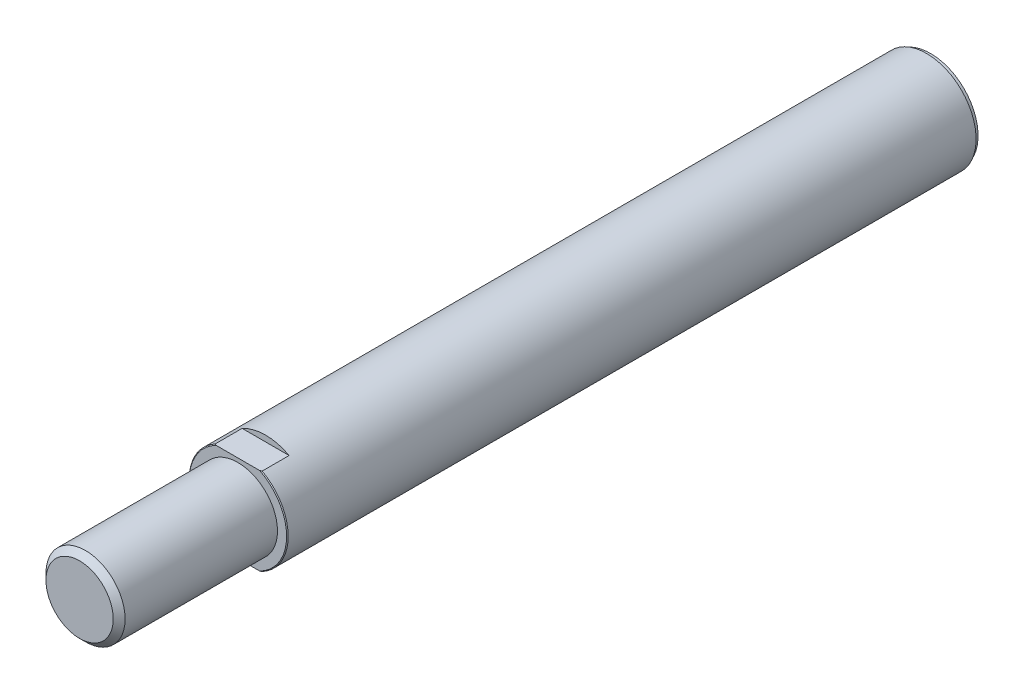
ISO-10303-21;
HEADER;
FILE_DESCRIPTION(('STEP AP214'),'2;1');
FILE_NAME('part.step','',(''),(''),'','','');
FILE_SCHEMA(('AUTOMOTIVE_DESIGN { 1 0 10303 214 1 1 1 1 }'));
ENDSEC;
DATA;
#1=APPLICATION_CONTEXT('core data for automotive mechanical design processes');
#2=APPLICATION_PROTOCOL_DEFINITION('international standard','automotive_design',2000,#1);
#3=PRODUCT_CONTEXT('',#1,'mechanical');
#4=PRODUCT('Part','Part','',(#3));
#5=PRODUCT_RELATED_PRODUCT_CATEGORY('part','',(#4));
#6=PRODUCT_DEFINITION_FORMATION('','',#4);
#7=PRODUCT_DEFINITION_CONTEXT('part definition',#1,'design');
#8=PRODUCT_DEFINITION('design','',#6,#7);
#9=PRODUCT_DEFINITION_SHAPE('','',#8);
#10=(LENGTH_UNIT() NAMED_UNIT(*) SI_UNIT(.MILLI.,.METRE.));
#11=(NAMED_UNIT(*) PLANE_ANGLE_UNIT() SI_UNIT($,.RADIAN.));
#12=(NAMED_UNIT(*) SI_UNIT($,.STERADIAN.) SOLID_ANGLE_UNIT());
#13=UNCERTAINTY_MEASURE_WITH_UNIT(LENGTH_MEASURE(1.E-05),#10,'distance_accuracy_value','');
#14=(GEOMETRIC_REPRESENTATION_CONTEXT(3) GLOBAL_UNCERTAINTY_ASSIGNED_CONTEXT((#13)) GLOBAL_UNIT_ASSIGNED_CONTEXT((#10,
#11,#12)) REPRESENTATION_CONTEXT('',''));
#15=CARTESIAN_POINT('',(0.,0.,0.));
#16=DIRECTION('',(0.,0.,1.));
#17=DIRECTION('',(1.,0.,0.));
#18=AXIS2_PLACEMENT_3D('',#15,#16,#17);
#19=CARTESIAN_POINT('',(0.,0.,215.));
#20=DIRECTION('',(0.,0.,-1.));
#21=DIRECTION('',(-1.,0.,0.));
#22=AXIS2_PLACEMENT_3D('',#19,#20,#21);
#23=CYLINDRICAL_SURFACE('',#22,12.5);
#24=DIRECTION('',(0.,0.,-1.));
#25=VECTOR('',#24,1.);
#26=CARTESIAN_POINT('',(-5.93717104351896,-11.,215.));
#27=LINE('',#26,#25);
#28=CARTESIAN_POINT('',(-5.93717104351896,-11.,174.8));
#29=VERTEX_POINT('',#28);
#30=CARTESIAN_POINT('',(-5.93717104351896,-11.,168.));
#31=VERTEX_POINT('',#30);
#32=EDGE_CURVE('E134',#29,#31,#27,.T.);
#33=ORIENTED_EDGE('',*,*,#32,.F.);
#34=CARTESIAN_POINT('',(0.,0.,174.8));
#35=DIRECTION('',(0.,0.,1.));
#36=DIRECTION('',(1.,0.,0.));
#37=AXIS2_PLACEMENT_3D('',#34,#35,#36);
#38=CIRCLE('',#37,12.5);
#39=CARTESIAN_POINT('',(-5.93717104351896,11.,174.8));
#40=VERTEX_POINT('',#39);
#41=EDGE_CURVE('E146',#29,#40,#38,.F.);
#42=ORIENTED_EDGE('',*,*,#41,.T.);
#43=DIRECTION('',(0.,0.,-1.));
#44=VECTOR('',#43,1.);
#45=CARTESIAN_POINT('',(-5.93717104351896,11.,215.));
#46=LINE('',#45,#44);
#47=CARTESIAN_POINT('',(-5.93717104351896,11.,168.));
#48=VERTEX_POINT('',#47);
#49=EDGE_CURVE('E58',#48,#40,#46,.F.);
#50=ORIENTED_EDGE('',*,*,#49,.F.);
#51=CARTESIAN_POINT('',(0.,0.,168.));
#52=DIRECTION('',(0.,0.,1.));
#53=DIRECTION('',(1.,0.,0.));
#54=AXIS2_PLACEMENT_3D('',#51,#52,#53);
#55=CIRCLE('',#54,12.5);
#56=CARTESIAN_POINT('',(5.93717104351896,11.,168.));
#57=VERTEX_POINT('',#56);
#58=EDGE_CURVE('E329',#57,#48,#55,.T.);
#59=ORIENTED_EDGE('',*,*,#58,.F.);
#60=DIRECTION('',(0.,0.,-1.));
#61=VECTOR('',#60,1.);
#62=CARTESIAN_POINT('',(5.93717104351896,11.,215.));
#63=LINE('',#62,#61);
#64=CARTESIAN_POINT('',(5.93717104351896,11.,174.8));
#65=VERTEX_POINT('',#64);
#66=EDGE_CURVE('E131',#65,#57,#63,.T.);
#67=ORIENTED_EDGE('',*,*,#66,.F.);
#68=CARTESIAN_POINT('',(5.93717104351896,-11.,174.8));
#69=VERTEX_POINT('',#68);
#70=EDGE_CURVE('E143',#65,#69,#38,.F.);
#71=ORIENTED_EDGE('',*,*,#70,.T.);
#72=DIRECTION('',(0.,0.,-1.));
#73=VECTOR('',#72,1.);
#74=CARTESIAN_POINT('',(5.93717104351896,-11.,215.));
#75=LINE('',#74,#73);
#76=CARTESIAN_POINT('',(5.93717104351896,-11.,168.));
#77=VERTEX_POINT('',#76);
#78=EDGE_CURVE('E66',#77,#69,#75,.F.);
#79=ORIENTED_EDGE('',*,*,#78,.F.);
#80=EDGE_CURVE('E332',#31,#77,#55,.T.);
#81=ORIENTED_EDGE('',*,*,#80,.F.);
#82=EDGE_LOOP('',(#33,#42,#50,#59,#67,#71,#79,#81));
#83=FACE_BOUND('',#82,.T.);
#84=CARTESIAN_POINT('',(0.,0.,1.));
#85=DIRECTION('',(0.,0.,-1.));
#86=DIRECTION('',(-1.,0.,0.));
#87=AXIS2_PLACEMENT_3D('',#84,#85,#86);
#88=CIRCLE('',#87,12.5);
#89=CARTESIAN_POINT('',(-12.5,0.,1.));
#90=VERTEX_POINT('',#89);
#91=EDGE_CURVE('E46',#90,#90,#88,.T.);
#92=ORIENTED_EDGE('',*,*,#91,.F.);
#93=EDGE_LOOP('',(#92));
#94=FACE_BOUND('',#93,.T.);
#95=ADVANCED_FACE('F42',(#83,#94),#23,.T.);
#96=CARTESIAN_POINT('',(0.,0.,175.));
#97=DIRECTION('',(0.,0.,1.));
#98=DIRECTION('',(1.,0.,0.));
#99=AXIS2_PLACEMENT_3D('',#96,#97,#98);
#100=PLANE('',#99);
#101=CARTESIAN_POINT('',(0.,0.,175.));
#102=DIRECTION('',(0.,0.,1.));
#103=DIRECTION('',(1.,0.,0.));
#104=AXIS2_PLACEMENT_3D('',#101,#102,#103);
#105=CIRCLE('',#104,10.);
#106=CARTESIAN_POINT('',(10.,0.,175.));
#107=VERTEX_POINT('',#106);
#108=EDGE_CURVE('E136',#107,#107,#105,.T.);
#109=ORIENTED_EDGE('',*,*,#108,.F.);
#110=EDGE_LOOP('',(#109));
#111=FACE_BOUND('',#110,.T.);
#112=CARTESIAN_POINT('',(0.,0.,175.));
#113=DIRECTION('',(0.,0.,1.));
#114=DIRECTION('',(1.,0.,0.));
#115=AXIS2_PLACEMENT_3D('',#112,#113,#114);
#116=CIRCLE('',#115,12.3);
#117=CARTESIAN_POINT('',(-5.50363516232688,11.,175.));
#118=VERTEX_POINT('',#117);
#119=CARTESIAN_POINT('',(-5.50363516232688,-11.,175.));
#120=VERTEX_POINT('',#119);
#121=EDGE_CURVE('E142',#118,#120,#116,.T.);
#122=ORIENTED_EDGE('',*,*,#121,.T.);
#123=DIRECTION('',(1.,0.,0.));
#124=VECTOR('',#123,1.);
#125=CARTESIAN_POINT('',(-18.9676132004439,-11.,175.));
#126=LINE('',#125,#124);
#127=CARTESIAN_POINT('',(5.50363516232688,-11.,175.));
#128=VERTEX_POINT('',#127);
#129=EDGE_CURVE('E123',#120,#128,#126,.T.);
#130=ORIENTED_EDGE('',*,*,#129,.T.);
#131=CARTESIAN_POINT('',(5.50363516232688,11.,175.));
#132=VERTEX_POINT('',#131);
#133=EDGE_CURVE('E139',#128,#132,#116,.T.);
#134=ORIENTED_EDGE('',*,*,#133,.T.);
#135=DIRECTION('',(-1.,0.,0.));
#136=VECTOR('',#135,1.);
#137=CARTESIAN_POINT('',(-18.9676132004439,11.,175.));
#138=LINE('',#137,#136);
#139=EDGE_CURVE('E125',#132,#118,#138,.T.);
#140=ORIENTED_EDGE('',*,*,#139,.T.);
#141=EDGE_LOOP('',(#122,#130,#134,#140));
#142=FACE_BOUND('',#141,.T.);
#143=ADVANCED_FACE('F183',(#111,#142),#100,.T.);
#144=CARTESIAN_POINT('',(0.,0.,175.));
#145=DIRECTION('',(0.,0.,-1.));
#146=DIRECTION('',(-1.,0.,0.));
#147=AXIS2_PLACEMENT_3D('',#144,#145,#146);
#148=CONICAL_SURFACE('',#147,12.3,0.785398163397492);
#149=ORIENTED_EDGE('',*,*,#41,.F.);
#150=CARTESIAN_POINT('',(-25.2049082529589,-11.,159.79932000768));
#151=CARTESIAN_POINT('',(-24.8332961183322,-11.,160.139899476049));
#152=CARTESIAN_POINT('',(-24.4610927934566,-11.,160.479835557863));
#153=CARTESIAN_POINT('',(-23.7153278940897,-11.,161.158220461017));
#154=CARTESIAN_POINT('',(-23.3417663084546,-11.,161.496669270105));
#155=CARTESIAN_POINT('',(-22.5930262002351,-11.,162.1719537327));
#156=CARTESIAN_POINT('',(-22.2178473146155,-11.,162.508788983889));
#157=CARTESIAN_POINT('',(-21.4657494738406,-11.,163.18051046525));
#158=CARTESIAN_POINT('',(-21.0888305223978,-11.,163.515396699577));
#159=CARTESIAN_POINT('',(-20.3305063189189,-11.,164.185120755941));
#160=CARTESIAN_POINT('',(-19.9490878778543,-11.,164.519943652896));
#161=CARTESIAN_POINT('',(-19.1839299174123,-11.,165.186926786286));
#162=CARTESIAN_POINT('',(-18.8001904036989,-11.,165.519087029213));
#163=CARTESIAN_POINT('',(-18.0300668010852,-11.,166.180238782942));
#164=CARTESIAN_POINT('',(-17.6436830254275,-11.,166.509230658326));
#165=CARTESIAN_POINT('',(-16.8677829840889,-11.,167.163501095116));
#166=CARTESIAN_POINT('',(-16.4782667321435,-11.,167.488779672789));
#167=CARTESIAN_POINT('',(-15.7614675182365,-11.,168.080475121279));
#168=CARTESIAN_POINT('',(-15.4347519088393,-11.,168.347578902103));
#169=CARTESIAN_POINT('',(-14.7783997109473,-11.,168.878171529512));
#170=CARTESIAN_POINT('',(-14.4487631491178,-11.,169.14166040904));
#171=CARTESIAN_POINT('',(-13.7860202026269,-11.,169.664443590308));
#172=CARTESIAN_POINT('',(-13.4529128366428,-11.,169.923736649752));
#173=CARTESIAN_POINT('',(-12.7827870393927,-11.,170.43722206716));
#174=CARTESIAN_POINT('',(-12.4457686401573,-11.,170.69141446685));
#175=CARTESIAN_POINT('',(-11.7675925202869,-11.,171.193346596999));
#176=CARTESIAN_POINT('',(-11.4264404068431,-11.,171.441093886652));
#177=CARTESIAN_POINT('',(-10.7388110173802,-11.,171.929138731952));
#178=CARTESIAN_POINT('',(-10.3923335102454,-11.,172.169435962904));
#179=CARTESIAN_POINT('',(-9.69333013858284,-11.,172.640735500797));
#180=CARTESIAN_POINT('',(-9.34080722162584,-11.,172.871742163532));
#181=CARTESIAN_POINT('',(-8.62854944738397,-11.,173.322311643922));
#182=CARTESIAN_POINT('',(-8.26881550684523,-11.,173.541875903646));
#183=CARTESIAN_POINT('',(-7.5462240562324,-11.,173.963558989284));
#184=CARTESIAN_POINT('',(-7.18348838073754,-11.,174.165885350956));
#185=CARTESIAN_POINT('',(-6.44862768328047,-11.,174.552951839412));
#186=CARTESIAN_POINT('',(-6.07650171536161,-11.,174.737690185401));
#187=CARTESIAN_POINT('',(-5.32234700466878,-11.,175.084623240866));
#188=CARTESIAN_POINT('',(-4.94033118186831,-11.,175.246845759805));
#189=CARTESIAN_POINT('',(-4.16548005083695,-11.,175.543160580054));
#190=CARTESIAN_POINT('',(-3.77264786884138,-11.,175.677260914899));
#191=CARTESIAN_POINT('',(-3.05749092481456,-11.,175.887010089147));
#192=CARTESIAN_POINT('',(-2.73703620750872,-11.,175.968998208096));
#193=CARTESIAN_POINT('',(-2.09063675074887,-11.,176.107537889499));
#194=CARTESIAN_POINT('',(-1.76469277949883,-11.,176.164092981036));
#195=CARTESIAN_POINT('',(-1.1099433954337,-11.,176.248894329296));
#196=CARTESIAN_POINT('',(-0.781147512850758,-11.,176.277213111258));
#197=CARTESIAN_POINT('',(-0.122326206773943,-11.,176.30424323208));
#198=CARTESIAN_POINT('',(0.207699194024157,-11.,176.302955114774));
#199=CARTESIAN_POINT('',(0.866187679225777,-11.,176.270850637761));
#200=CARTESIAN_POINT('',(1.19465120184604,-11.,176.240043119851));
#201=CARTESIAN_POINT('',(1.84773423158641,-11.,176.150587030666));
#202=CARTESIAN_POINT('',(2.17235340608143,-11.,176.091936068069));
#203=CARTESIAN_POINT('',(2.8169274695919,-11.,175.949408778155));
#204=CARTESIAN_POINT('',(3.13686596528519,-11.,175.865459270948));
#205=CARTESIAN_POINT('',(3.77013120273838,-11.,175.675776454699));
#206=CARTESIAN_POINT('',(4.08345803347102,-11.,175.570043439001));
#207=CARTESIAN_POINT('',(4.77959899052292,-11.,175.311847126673));
#208=CARTESIAN_POINT('',(5.16051287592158,-11.,175.154288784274));
#209=CARTESIAN_POINT('',(5.91217216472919,-11.,174.816371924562));
#210=CARTESIAN_POINT('',(6.28291247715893,-11.,174.636002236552));
#211=CARTESIAN_POINT('',(7.01572159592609,-11.,174.256923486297));
#212=CARTESIAN_POINT('',(7.37777248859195,-11.,174.058180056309));
#213=CARTESIAN_POINT('',(8.09354374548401,-11.,173.646436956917));
#214=CARTESIAN_POINT('',(8.44726541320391,-11.,173.433439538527));
#215=CARTESIAN_POINT('',(9.15130038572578,-11.,172.993709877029));
#216=CARTESIAN_POINT('',(9.50153682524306,-11.,172.766855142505));
#217=CARTESIAN_POINT('',(10.1957742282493,-11.,172.303768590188));
#218=CARTESIAN_POINT('',(10.5397746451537,-11.,172.06753595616));
#219=CARTESIAN_POINT('',(11.2225281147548,-11.,171.587386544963));
#220=CARTESIAN_POINT('',(11.5612793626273,-11.,171.343467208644));
#221=CARTESIAN_POINT('',(12.2341678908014,-11.,170.849383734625));
#222=CARTESIAN_POINT('',(12.5683053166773,-11.,170.599219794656));
#223=CARTESIAN_POINT('',(13.4491244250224,-11.,169.928993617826));
#224=CARTESIAN_POINT('',(13.9924028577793,-11.,169.504460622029));
#225=CARTESIAN_POINT('',(15.0704026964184,-11.,168.644933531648));
#226=CARTESIAN_POINT('',(15.6051257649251,-11.,168.209941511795));
#227=CARTESIAN_POINT('',(16.6682135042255,-11.,167.331532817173));
#228=CARTESIAN_POINT('',(17.1965735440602,-11.,166.888110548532));
#229=CARTESIAN_POINT('',(18.2478896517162,-11.,165.99486689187));
#230=CARTESIAN_POINT('',(18.7708454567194,-11.,165.545045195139));
#231=CARTESIAN_POINT('',(19.7911752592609,-11.,164.658678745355));
#232=CARTESIAN_POINT('',(20.2887256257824,-11.,164.222336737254));
#233=CARTESIAN_POINT('',(21.2804238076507,-11.,163.345821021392));
#234=CARTESIAN_POINT('',(21.7745716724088,-11.,162.905647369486));
#235=CARTESIAN_POINT('',(22.7594616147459,-11.,162.022629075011));
#236=CARTESIAN_POINT('',(23.2502069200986,-11.,161.579788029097));
#237=CARTESIAN_POINT('',(24.2292721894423,-11.,160.6914346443));
#238=CARTESIAN_POINT('',(24.7175921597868,-11.,160.245922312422));
#239=CARTESIAN_POINT('',(25.2049082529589,-11.,159.79932000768));
#240=B_SPLINE_CURVE_WITH_KNOTS('',3,(#150,#151,#152,#153,#154,#155,#156,#157,#158,#159,#160,
#161,#162,#163,#164,#165,#166,#167,#168,#169,#170,#171,#172,#173,#174,#175,#176,#177,#178,#179,
#180,#181,#182,#183,#184,#185,#186,#187,#188,#189,#190,#191,#192,#193,#194,#195,#196,#197,#198,
#199,#200,#201,#202,#203,#204,#205,#206,#207,#208,#209,#210,#211,#212,#213,#214,#215,#216,#217,
#218,#219,#220,#221,#222,#223,#224,#225,#226,#227,#228,#229,#230,#231,#232,#233,#234,#235,#236,
#237,#238,#239),.UNSPECIFIED.,.F.,.F.,(4,2,2,2,2,2,2,2,2,2,2,2,2,2,2,2,2,2,2,2,2,2,2,2,2,2,2,2,
2,2,2,2,2,2,2,2,2,2,2,2,2,2,2,2,4),(0.,1.51222100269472,3.02445444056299,4.53704712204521,
6.0496365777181,7.57221518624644,9.09479008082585,10.6171876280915,12.1395785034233,
13.4055696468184,14.6715492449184,15.9378970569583,17.2042345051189,18.4690128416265,
19.733846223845,20.9980795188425,22.2621530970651,23.5078130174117,24.7535989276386,
25.9978321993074,27.2417095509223,28.2331520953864,29.2244570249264,30.2132091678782,
31.2019431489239,32.1903810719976,33.1789039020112,34.1703140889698,35.1617109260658,
36.3973752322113,37.6336470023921,38.8722798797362,40.110717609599,41.3623951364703,
42.6141818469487,43.8663898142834,45.1185581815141,47.1867976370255,49.2546301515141,
51.3238862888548,53.3932425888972,55.3785544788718,57.3638374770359,59.346868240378,
61.3298938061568),.UNSPECIFIED.);
#241=EDGE_CURVE('E325',#29,#120,#240,.T.);
#242=ORIENTED_EDGE('',*,*,#241,.T.);
#243=ORIENTED_EDGE('',*,*,#121,.F.);
#244=CARTESIAN_POINT('',(25.2049082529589,11.,159.79932000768));
#245=CARTESIAN_POINT('',(24.8332961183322,11.,160.139899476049));
#246=CARTESIAN_POINT('',(24.4610927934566,11.,160.479835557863));
#247=CARTESIAN_POINT('',(23.7153278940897,11.,161.158220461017));
#248=CARTESIAN_POINT('',(23.3417663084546,11.,161.496669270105));
#249=CARTESIAN_POINT('',(22.5930262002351,11.,162.1719537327));
#250=CARTESIAN_POINT('',(22.2178473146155,11.,162.508788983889));
#251=CARTESIAN_POINT('',(21.4657494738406,11.,163.18051046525));
#252=CARTESIAN_POINT('',(21.0888305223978,11.,163.515396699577));
#253=CARTESIAN_POINT('',(20.3305063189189,11.,164.185120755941));
#254=CARTESIAN_POINT('',(19.9490878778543,11.,164.519943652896));
#255=CARTESIAN_POINT('',(19.1839299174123,11.,165.186926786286));
#256=CARTESIAN_POINT('',(18.8001904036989,11.,165.519087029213));
#257=CARTESIAN_POINT('',(18.0300668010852,11.,166.180238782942));
#258=CARTESIAN_POINT('',(17.6436830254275,11.,166.509230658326));
#259=CARTESIAN_POINT('',(16.8677829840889,11.,167.163501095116));
#260=CARTESIAN_POINT('',(16.4782667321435,11.,167.488779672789));
#261=CARTESIAN_POINT('',(15.7614675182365,11.,168.080475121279));
#262=CARTESIAN_POINT('',(15.4347519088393,11.,168.347578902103));
#263=CARTESIAN_POINT('',(14.7783997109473,11.,168.878171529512));
#264=CARTESIAN_POINT('',(14.4487631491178,11.,169.14166040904));
#265=CARTESIAN_POINT('',(13.7860202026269,11.,169.664443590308));
#266=CARTESIAN_POINT('',(13.4529128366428,11.,169.923736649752));
#267=CARTESIAN_POINT('',(12.7827870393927,11.,170.43722206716));
#268=CARTESIAN_POINT('',(12.4457686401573,11.,170.69141446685));
#269=CARTESIAN_POINT('',(11.7675925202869,11.,171.193346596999));
#270=CARTESIAN_POINT('',(11.4264404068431,11.,171.441093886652));
#271=CARTESIAN_POINT('',(10.7388110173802,11.,171.929138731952));
#272=CARTESIAN_POINT('',(10.3923335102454,11.,172.169435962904));
#273=CARTESIAN_POINT('',(9.69333013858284,11.,172.640735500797));
#274=CARTESIAN_POINT('',(9.34080722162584,11.,172.871742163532));
#275=CARTESIAN_POINT('',(8.62854944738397,11.,173.322311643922));
#276=CARTESIAN_POINT('',(8.26881550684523,11.,173.541875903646));
#277=CARTESIAN_POINT('',(7.5462240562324,11.,173.963558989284));
#278=CARTESIAN_POINT('',(7.18348838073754,11.,174.165885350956));
#279=CARTESIAN_POINT('',(6.44862768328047,11.,174.552951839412));
#280=CARTESIAN_POINT('',(6.07650171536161,11.,174.737690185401));
#281=CARTESIAN_POINT('',(5.32234700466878,11.,175.084623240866));
#282=CARTESIAN_POINT('',(4.94033118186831,11.,175.246845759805));
#283=CARTESIAN_POINT('',(4.16548005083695,11.,175.543160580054));
#284=CARTESIAN_POINT('',(3.77264786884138,11.,175.677260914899));
#285=CARTESIAN_POINT('',(3.05749092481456,11.,175.887010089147));
#286=CARTESIAN_POINT('',(2.73703620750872,11.,175.968998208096));
#287=CARTESIAN_POINT('',(2.09063675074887,11.,176.107537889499));
#288=CARTESIAN_POINT('',(1.76469277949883,11.,176.164092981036));
#289=CARTESIAN_POINT('',(1.1099433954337,11.,176.248894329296));
#290=CARTESIAN_POINT('',(0.781147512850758,11.,176.277213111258));
#291=CARTESIAN_POINT('',(0.122326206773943,11.,176.30424323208));
#292=CARTESIAN_POINT('',(-0.207699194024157,11.,176.302955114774));
#293=CARTESIAN_POINT('',(-0.866187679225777,11.,176.270850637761));
#294=CARTESIAN_POINT('',(-1.19465120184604,11.,176.240043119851));
#295=CARTESIAN_POINT('',(-1.84773423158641,11.,176.150587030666));
#296=CARTESIAN_POINT('',(-2.17235340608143,11.,176.091936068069));
#297=CARTESIAN_POINT('',(-2.8169274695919,11.,175.949408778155));
#298=CARTESIAN_POINT('',(-3.13686596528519,11.,175.865459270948));
#299=CARTESIAN_POINT('',(-3.77013120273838,11.,175.675776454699));
#300=CARTESIAN_POINT('',(-4.08345803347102,11.,175.570043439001));
#301=CARTESIAN_POINT('',(-4.77959899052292,11.,175.311847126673));
#302=CARTESIAN_POINT('',(-5.16051287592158,11.,175.154288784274));
#303=CARTESIAN_POINT('',(-5.91217216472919,11.,174.816371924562));
#304=CARTESIAN_POINT('',(-6.28291247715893,11.,174.636002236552));
#305=CARTESIAN_POINT('',(-7.01572159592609,11.,174.256923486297));
#306=CARTESIAN_POINT('',(-7.37777248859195,11.,174.058180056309));
#307=CARTESIAN_POINT('',(-8.09354374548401,11.,173.646436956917));
#308=CARTESIAN_POINT('',(-8.44726541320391,11.,173.433439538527));
#309=CARTESIAN_POINT('',(-9.15130038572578,11.,172.993709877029));
#310=CARTESIAN_POINT('',(-9.50153682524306,11.,172.766855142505));
#311=CARTESIAN_POINT('',(-10.1957742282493,11.,172.303768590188));
#312=CARTESIAN_POINT('',(-10.5397746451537,11.,172.06753595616));
#313=CARTESIAN_POINT('',(-11.2225281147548,11.,171.587386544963));
#314=CARTESIAN_POINT('',(-11.5612793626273,11.,171.343467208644));
#315=CARTESIAN_POINT('',(-12.2341678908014,11.,170.849383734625));
#316=CARTESIAN_POINT('',(-12.5683053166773,11.,170.599219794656));
#317=CARTESIAN_POINT('',(-13.4491244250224,11.,169.928993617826));
#318=CARTESIAN_POINT('',(-13.9924028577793,11.,169.504460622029));
#319=CARTESIAN_POINT('',(-15.0704026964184,11.,168.644933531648));
#320=CARTESIAN_POINT('',(-15.6051257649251,11.,168.209941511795));
#321=CARTESIAN_POINT('',(-16.6682135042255,11.,167.331532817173));
#322=CARTESIAN_POINT('',(-17.1965735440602,11.,166.888110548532));
#323=CARTESIAN_POINT('',(-18.2478896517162,11.,165.99486689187));
#324=CARTESIAN_POINT('',(-18.7708454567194,11.,165.545045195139));
#325=CARTESIAN_POINT('',(-19.7911752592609,11.,164.658678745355));
#326=CARTESIAN_POINT('',(-20.2887256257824,11.,164.222336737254));
#327=CARTESIAN_POINT('',(-21.2804238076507,11.,163.345821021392));
#328=CARTESIAN_POINT('',(-21.7745716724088,11.,162.905647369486));
#329=CARTESIAN_POINT('',(-22.7594616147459,11.,162.022629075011));
#330=CARTESIAN_POINT('',(-23.2502069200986,11.,161.579788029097));
#331=CARTESIAN_POINT('',(-24.2292721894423,11.,160.6914346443));
#332=CARTESIAN_POINT('',(-24.7175921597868,11.,160.245922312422));
#333=CARTESIAN_POINT('',(-25.2049082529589,11.,159.79932000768));
#334=B_SPLINE_CURVE_WITH_KNOTS('',3,(#244,#245,#246,#247,#248,#249,#250,#251,#252,#253,#254,
#255,#256,#257,#258,#259,#260,#261,#262,#263,#264,#265,#266,#267,#268,#269,#270,#271,#272,#273,
#274,#275,#276,#277,#278,#279,#280,#281,#282,#283,#284,#285,#286,#287,#288,#289,#290,#291,#292,
#293,#294,#295,#296,#297,#298,#299,#300,#301,#302,#303,#304,#305,#306,#307,#308,#309,#310,#311,
#312,#313,#314,#315,#316,#317,#318,#319,#320,#321,#322,#323,#324,#325,#326,#327,#328,#329,#330,
#331,#332,#333),.UNSPECIFIED.,.F.,.F.,(4,2,2,2,2,2,2,2,2,2,2,2,2,2,2,2,2,2,2,2,2,2,2,2,2,2,2,2,
2,2,2,2,2,2,2,2,2,2,2,2,2,2,2,2,4),(0.,1.51222100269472,3.02445444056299,4.53704712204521,
6.0496365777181,7.57221518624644,9.09479008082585,10.6171876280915,12.1395785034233,
13.4055696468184,14.6715492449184,15.9378970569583,17.2042345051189,18.4690128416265,
19.733846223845,20.9980795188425,22.2621530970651,23.5078130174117,24.7535989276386,
25.9978321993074,27.2417095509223,28.2331520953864,29.2244570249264,30.2132091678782,
31.2019431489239,32.1903810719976,33.1789039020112,34.1703140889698,35.1617109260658,
36.3973752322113,37.6336470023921,38.8722798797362,40.110717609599,41.3623951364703,
42.6141818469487,43.8663898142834,45.1185581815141,47.1867976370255,49.2546301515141,
51.3238862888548,53.3932425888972,55.3785544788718,57.3638374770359,59.346868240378,
61.3298938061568),.UNSPECIFIED.);
#335=EDGE_CURVE('E147',#118,#40,#334,.T.);
#336=ORIENTED_EDGE('',*,*,#335,.T.);
#337=EDGE_LOOP('',(#149,#242,#243,#336));
#338=FACE_BOUND('',#337,.T.);
#339=ADVANCED_FACE('F162',(#338),#148,.T.);
#340=ORIENTED_EDGE('',*,*,#133,.F.);
#341=EDGE_CURVE('E155',#128,#69,#240,.T.);
#342=ORIENTED_EDGE('',*,*,#341,.T.);
#343=ORIENTED_EDGE('',*,*,#70,.F.);
#344=EDGE_CURVE('E154',#65,#132,#334,.T.);
#345=ORIENTED_EDGE('',*,*,#344,.T.);
#346=EDGE_LOOP('',(#340,#342,#343,#345));
#347=FACE_BOUND('',#346,.T.);
#348=ADVANCED_FACE('F181',(#347),#148,.T.);
#349=CARTESIAN_POINT('',(0.,0.,175.));
#350=DIRECTION('',(0.,0.,1.));
#351=DIRECTION('',(1.,0.,0.));
#352=AXIS2_PLACEMENT_3D('',#349,#350,#351);
#353=CYLINDRICAL_SURFACE('',#352,10.);
#354=CARTESIAN_POINT('',(0.,0.,213.5));
#355=DIRECTION('',(0.,0.,1.));
#356=DIRECTION('',(1.,0.,0.));
#357=AXIS2_PLACEMENT_3D('',#354,#355,#356);
#358=CIRCLE('',#357,10.);
#359=CARTESIAN_POINT('',(10.,0.,213.5));
#360=VERTEX_POINT('',#359);
#361=EDGE_CURVE('E12',#360,#360,#358,.F.);
#362=ORIENTED_EDGE('',*,*,#361,.T.);
#363=EDGE_LOOP('',(#362));
#364=FACE_BOUND('',#363,.T.);
#365=ORIENTED_EDGE('',*,*,#108,.T.);
#366=EDGE_LOOP('',(#365));
#367=FACE_BOUND('',#366,.T.);
#368=ADVANCED_FACE('F178',(#364,#367),#353,.T.);
#369=CARTESIAN_POINT('',(0.,0.,215.));
#370=DIRECTION('',(0.,0.,1.));
#371=DIRECTION('',(1.,0.,0.));
#372=AXIS2_PLACEMENT_3D('',#369,#370,#371);
#373=PLANE('',#372);
#374=CARTESIAN_POINT('',(0.,0.,215.));
#375=DIRECTION('',(0.,0.,1.));
#376=DIRECTION('',(1.,0.,0.));
#377=AXIS2_PLACEMENT_3D('',#374,#375,#376);
#378=CIRCLE('',#377,8.49999999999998);
#379=CARTESIAN_POINT('',(8.49999999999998,0.,215.));
#380=VERTEX_POINT('',#379);
#381=EDGE_CURVE('E51',#380,#380,#378,.T.);
#382=ORIENTED_EDGE('',*,*,#381,.T.);
#383=EDGE_LOOP('',(#382));
#384=FACE_BOUND('',#383,.T.);
#385=ADVANCED_FACE('F170',(#384),#373,.T.);
#386=CARTESIAN_POINT('',(-18.9676132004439,11.,168.));
#387=DIRECTION('',(0.,1.,0.));
#388=DIRECTION('',(0.,0.,1.));
#389=AXIS2_PLACEMENT_3D('',#386,#387,#388);
#390=PLANE('',#389);
#391=ORIENTED_EDGE('',*,*,#66,.T.);
#392=DIRECTION('',(-1.,0.,0.));
#393=VECTOR('',#392,1.);
#394=CARTESIAN_POINT('',(-18.9676132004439,11.,168.));
#395=LINE('',#394,#393);
#396=EDGE_CURVE('E120',#57,#48,#395,.T.);
#397=ORIENTED_EDGE('',*,*,#396,.T.);
#398=ORIENTED_EDGE('',*,*,#49,.T.);
#399=ORIENTED_EDGE('',*,*,#335,.F.);
#400=ORIENTED_EDGE('',*,*,#139,.F.);
#401=ORIENTED_EDGE('',*,*,#344,.F.);
#402=EDGE_LOOP('',(#391,#397,#398,#399,#400,#401));
#403=FACE_BOUND('',#402,.T.);
#404=ADVANCED_FACE('F165',(#403),#390,.T.);
#405=CARTESIAN_POINT('',(0.,0.,168.));
#406=DIRECTION('',(0.,0.,1.));
#407=DIRECTION('',(1.,0.,0.));
#408=AXIS2_PLACEMENT_3D('',#405,#406,#407);
#409=PLANE('',#408);
#410=ORIENTED_EDGE('',*,*,#58,.T.);
#411=ORIENTED_EDGE('',*,*,#396,.F.);
#412=EDGE_LOOP('',(#410,#411));
#413=FACE_BOUND('',#412,.T.);
#414=ADVANCED_FACE('F169',(#413),#409,.T.);
#415=ORIENTED_EDGE('',*,*,#80,.T.);
#416=DIRECTION('',(1.,0.,0.));
#417=VECTOR('',#416,1.);
#418=CARTESIAN_POINT('',(-18.9676132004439,-11.,168.));
#419=LINE('',#418,#417);
#420=EDGE_CURVE('E122',#31,#77,#419,.T.);
#421=ORIENTED_EDGE('',*,*,#420,.F.);
#422=EDGE_LOOP('',(#415,#421));
#423=FACE_BOUND('',#422,.T.);
#424=ADVANCED_FACE('F176',(#423),#409,.T.);
#425=CARTESIAN_POINT('',(-18.9676132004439,-11.,168.));
#426=DIRECTION('',(0.,-1.,0.));
#427=DIRECTION('',(0.,0.,-1.));
#428=AXIS2_PLACEMENT_3D('',#425,#426,#427);
#429=PLANE('',#428);
#430=ORIENTED_EDGE('',*,*,#32,.T.);
#431=ORIENTED_EDGE('',*,*,#420,.T.);
#432=ORIENTED_EDGE('',*,*,#78,.T.);
#433=ORIENTED_EDGE('',*,*,#341,.F.);
#434=ORIENTED_EDGE('',*,*,#129,.F.);
#435=ORIENTED_EDGE('',*,*,#241,.F.);
#436=EDGE_LOOP('',(#430,#431,#432,#433,#434,#435));
#437=FACE_BOUND('',#436,.T.);
#438=ADVANCED_FACE('F171',(#437),#429,.T.);
#439=CARTESIAN_POINT('',(0.,0.,215.));
#440=DIRECTION('',(0.,0.,-1.));
#441=DIRECTION('',(-1.,0.,0.));
#442=AXIS2_PLACEMENT_3D('',#439,#440,#441);
#443=CONICAL_SURFACE('',#442,8.49999999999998,0.785398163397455);
#444=ORIENTED_EDGE('',*,*,#361,.F.);
#445=EDGE_LOOP('',(#444));
#446=FACE_BOUND('',#445,.T.);
#447=ORIENTED_EDGE('',*,*,#381,.F.);
#448=EDGE_LOOP('',(#447));
#449=FACE_BOUND('',#448,.T.);
#450=ADVANCED_FACE('F44',(#446,#449),#443,.T.);
#451=CARTESIAN_POINT('',(0.,0.,1.));
#452=DIRECTION('',(0.,0.,-1.));
#453=DIRECTION('',(-1.,0.,0.));
#454=AXIS2_PLACEMENT_3D('',#451,#452,#453);
#455=PLANE('',#454);
#456=CARTESIAN_POINT('',(0.,0.,1.));
#457=DIRECTION('',(0.,0.,-1.));
#458=DIRECTION('',(-1.,0.,0.));
#459=AXIS2_PLACEMENT_3D('',#456,#457,#458);
#460=CIRCLE('',#459,12.);
#461=CARTESIAN_POINT('',(-12.,0.,1.));
#462=VERTEX_POINT('',#461);
#463=EDGE_CURVE('E113',#462,#462,#460,.T.);
#464=ORIENTED_EDGE('',*,*,#463,.F.);
#465=EDGE_LOOP('',(#464));
#466=FACE_BOUND('',#465,.T.);
#467=ORIENTED_EDGE('',*,*,#91,.T.);
#468=EDGE_LOOP('',(#467));
#469=FACE_BOUND('',#468,.T.);
#470=ADVANCED_FACE('F205',(#466,#469),#455,.T.);
#471=CARTESIAN_POINT('',(0.,0.,1.));
#472=DIRECTION('',(0.,0.,-1.));
#473=DIRECTION('',(-1.,0.,0.));
#474=AXIS2_PLACEMENT_3D('',#471,#472,#473);
#475=CYLINDRICAL_SURFACE('',#474,12.);
#476=ORIENTED_EDGE('',*,*,#463,.T.);
#477=EDGE_LOOP('',(#476));
#478=FACE_BOUND('',#477,.T.);
#479=CARTESIAN_POINT('',(0.,0.,0.));
#480=DIRECTION('',(0.,0.,-1.));
#481=DIRECTION('',(-1.,0.,0.));
#482=AXIS2_PLACEMENT_3D('',#479,#480,#481);
#483=CIRCLE('',#482,12.);
#484=CARTESIAN_POINT('',(-12.,0.,0.));
#485=VERTEX_POINT('',#484);
#486=EDGE_CURVE('E109',#485,#485,#483,.T.);
#487=ORIENTED_EDGE('',*,*,#486,.F.);
#488=EDGE_LOOP('',(#487));
#489=FACE_BOUND('',#488,.T.);
#490=ADVANCED_FACE('F191',(#478,#489),#475,.T.);
#491=CARTESIAN_POINT('',(0.,0.,0.));
#492=DIRECTION('',(0.,0.,1.));
#493=DIRECTION('',(1.,0.,0.));
#494=AXIS2_PLACEMENT_3D('',#491,#492,#493);
#495=PLANE('',#494);
#496=CARTESIAN_POINT('',(0.,0.,0.));
#497=DIRECTION('',(0.,0.,-1.));
#498=DIRECTION('',(-1.,0.,0.));
#499=AXIS2_PLACEMENT_3D('',#496,#497,#498);
#500=CIRCLE('',#499,5.1);
#501=CARTESIAN_POINT('',(-5.1,0.,0.));
#502=VERTEX_POINT('',#501);
#503=EDGE_CURVE('E110',#502,#502,#500,.T.);
#504=ORIENTED_EDGE('',*,*,#503,.F.);
#505=EDGE_LOOP('',(#504));
#506=FACE_BOUND('',#505,.T.);
#507=ORIENTED_EDGE('',*,*,#486,.T.);
#508=EDGE_LOOP('',(#507));
#509=FACE_BOUND('',#508,.T.);
#510=ADVANCED_FACE('F103',(#506,#509),#495,.F.);
#511=CARTESIAN_POINT('',(0.,0.,32.75));
#512=DIRECTION('',(0.,0.,-1.));
#513=DIRECTION('',(-1.,0.,0.));
#514=AXIS2_PLACEMENT_3D('',#511,#512,#513);
#515=CONICAL_SURFACE('',#514,5.09999999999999,1.02974425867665);
#516=CARTESIAN_POINT('',(0.,0.,35.8143891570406));
#517=VERTEX_POINT('',#516);
#518=VERTEX_LOOP('',#517);
#519=FACE_BOUND('',#518,.T.);
#520=CARTESIAN_POINT('',(0.,0.,32.75));
#521=DIRECTION('',(0.,0.,-1.));
#522=DIRECTION('',(-1.,0.,0.));
#523=AXIS2_PLACEMENT_3D('',#520,#521,#522);
#524=CIRCLE('',#523,5.09999999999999);
#525=CARTESIAN_POINT('',(-5.09999999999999,0.,32.75));
#526=VERTEX_POINT('',#525);
#527=EDGE_CURVE('E107',#526,#526,#524,.T.);
#528=ORIENTED_EDGE('',*,*,#527,.T.);
#529=EDGE_LOOP('',(#528));
#530=FACE_BOUND('',#529,.T.);
#531=ADVANCED_FACE('F99',(#519,#530),#515,.F.);
#532=CARTESIAN_POINT('',(0.,0.,0.));
#533=DIRECTION('',(0.,0.,-1.));
#534=DIRECTION('',(-1.,0.,0.));
#535=AXIS2_PLACEMENT_3D('',#532,#533,#534);
#536=CYLINDRICAL_SURFACE('',#535,5.09999999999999);
#537=ORIENTED_EDGE('',*,*,#527,.F.);
#538=EDGE_LOOP('',(#537));
#539=FACE_BOUND('',#538,.T.);
#540=ORIENTED_EDGE('',*,*,#503,.T.);
#541=EDGE_LOOP('',(#540));
#542=FACE_BOUND('',#541,.T.);
#543=ADVANCED_FACE('F102',(#539,#542),#536,.F.);
#544=CLOSED_SHELL('',(#95,#143,#339,#348,#368,#385,#404,#414,#424,#438,#450,#470,#490,#510,#531,#543));
#545=MANIFOLD_SOLID_BREP('B2',#544);
#546=ADVANCED_BREP_SHAPE_REPRESENTATION('',(#18,#545),#14);
#547=SHAPE_DEFINITION_REPRESENTATION(#9,#546);
ENDSEC;
END-ISO-10303-21;
